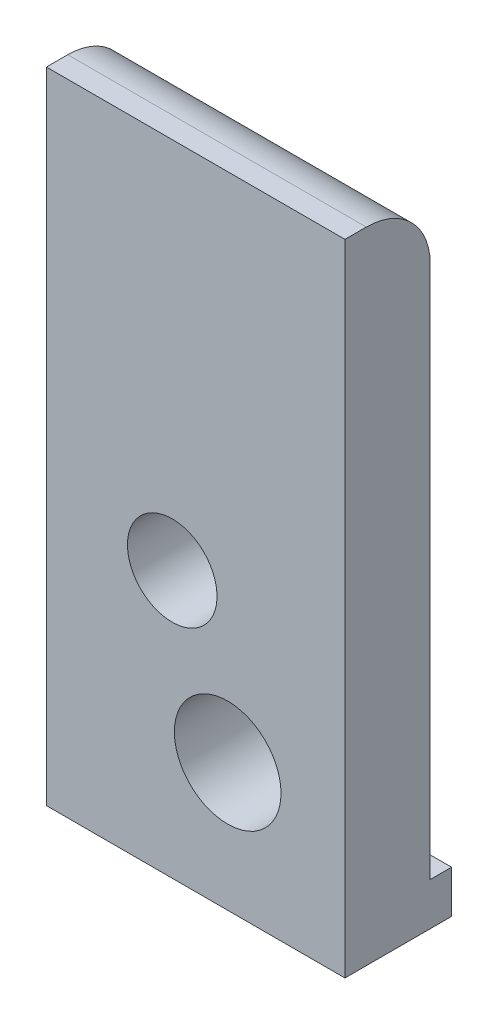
from build123d import *

# Parameters (mm, degrees)
ESQUISSE1_W                = 14
ESQUISSE1_H                = 30
BASE_EXTRUSION_DEPTH       = 5
ESQUISSE2_W                = 4
ESQUISSE2_H                = 29
ENL_V_MAT_EXTRU_2_DEPTH    = 34.481338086
CONG_2_R                   = 3
ENL_V_MAT_EXTRU_3_DEPTH    = 20
R_P_TITION_LIN_AIRE1_COUNT = 14
R_P_TITION_LIN_AIRE1_PITCH = 1
ESQUISSE10_W               = 2
ESQUISSE10_H               = 3
ENL_V_MAT_EXTRU_17_DEPTH   = 20
ESQUISSE11_W               = 2
ESQUISSE11_H               = 2
BOSS_EXTRU_2_DEPTH         = 14
ESQUISSE12_R               = 2.5
ENL_V_MAT_EXTRU_18_DEPTH   = 34.346664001
ESQUISSE13_R               = 2.1
ENL_V_MAT_EXTRU_19_DEPTH   = 14


with BuildPart() as part:
    # Esquisse1 → Base-Extrusion (new body)
    with BuildSketch(Plane.XY):
        with Locations((7, 15)):
            Rectangle(ESQUISSE1_W, ESQUISSE1_H)
    extrude(amount=BASE_EXTRUSION_DEPTH)

    # Esquisse2 → Enl_v. mat.-Extru.2 (cut, through all)
    with BuildSketch(Plane(origin=(14, 0, 0), x_dir=(0, 0, -1), z_dir=(1, 0, 0))):
        with Locations((-6, 16.5)):
            Rectangle(ESQUISSE2_W, ESQUISSE2_H)
    extrude(amount=-ENL_V_MAT_EXTRU_2_DEPTH, mode=Mode.SUBTRACT)

    # Cong_2
    cong_2_edges = [part.edges().sort_by_distance(p)[0] for p in [
        (7, 30, 0),
    ]]
    fillet(cong_2_edges, radius=CONG_2_R)

    # Esquisse3 → Enl_v. mat.-Extru.3 (cut)
    with BuildSketch(Plane(origin=(0, 30, 0), x_dir=(-1, 0, 0), z_dir=(0, 1, 0))):
        Polygon((-13.9, 0), (-13.1, 0), (-13.5, 0.4), align=None)
    enl_v_mat_extru_3 = extrude(amount=-ENL_V_MAT_EXTRU_3_DEPTH, mode=Mode.SUBTRACT)

    # R_p_tition lin_aire1: Enl_v. mat.-Extru.3 ×14
    with Locations(*[(-i * R_P_TITION_LIN_AIRE1_PITCH, 0, 0) for i in range(1, R_P_TITION_LIN_AIRE1_COUNT)]):
        add(enl_v_mat_extru_3, mode=Mode.SUBTRACT)

    # Esquisse10 → Enl_v. mat.-Extru.17 (cut)
    with BuildSketch(Plane.ZY):
        with Locations((5, 0.5)):
            Rectangle(ESQUISSE10_W, ESQUISSE10_H)
    extrude(amount=-ENL_V_MAT_EXTRU_17_DEPTH, mode=Mode.SUBTRACT)

    # Esquisse11 → Boss.-Extru.2 (add)
    with BuildSketch(Plane.ZY):
        with Locations((0, 1)):
            Rectangle(ESQUISSE11_W, ESQUISSE11_H)
    extrude(amount=-BOSS_EXTRU_2_DEPTH)

    # Esquisse12 → Enl_v. mat.-Extru.18 (cut, through all)
    with BuildSketch(Plane(origin=(0, 0, 0), x_dir=(-1, 0, 0), z_dir=(0, 0, -1))):
        with Locations((-8.5, 6)):
            Circle(ESQUISSE12_R)
    extrude(amount=-ENL_V_MAT_EXTRU_18_DEPTH, mode=Mode.SUBTRACT)

    # Esquisse13 → Enl_v. mat.-Extru.19 (cut)
    with BuildSketch(Plane(origin=(0, 0, 0), x_dir=(-1, 0, 0), z_dir=(0, 0, -1))):
        with Locations((-5.9, 12.5)):
            Circle(ESQUISSE13_R)
    extrude(amount=-ENL_V_MAT_EXTRU_19_DEPTH, mode=Mode.SUBTRACT)


solid = part.part
